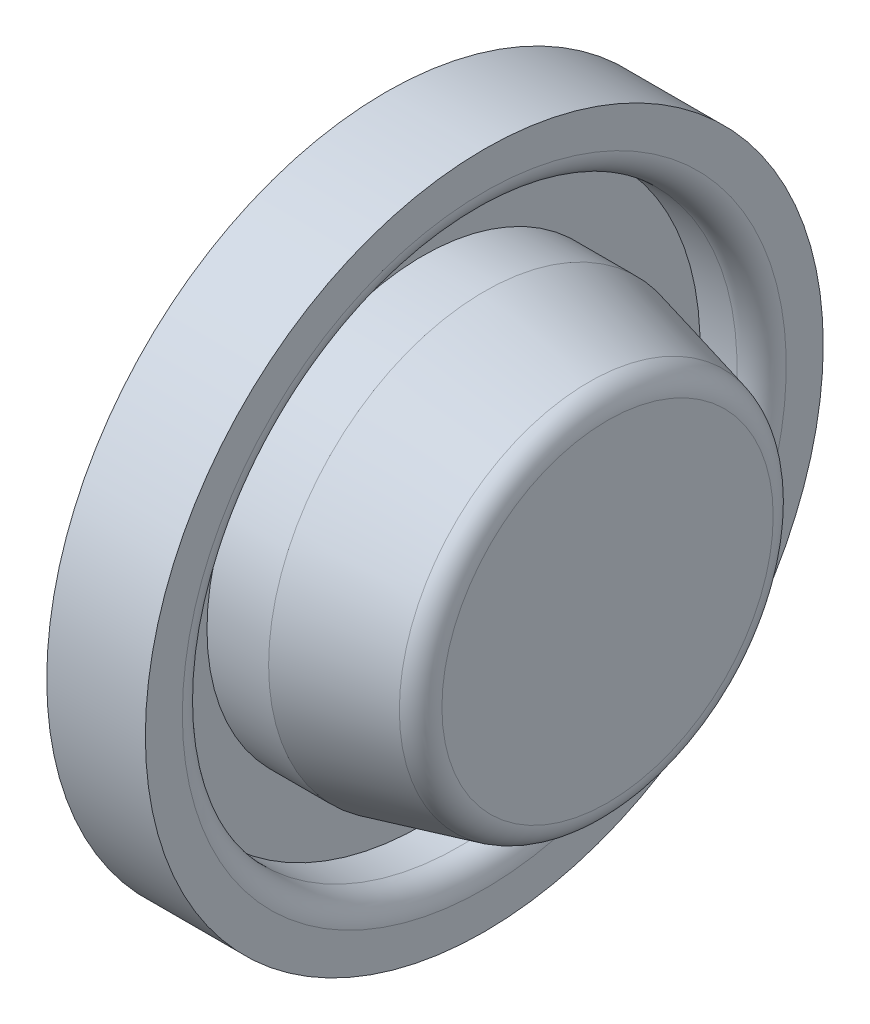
ISO-10303-21;
HEADER;
FILE_DESCRIPTION(('STEP AP214'),'2;1');
FILE_NAME('part.step','',(''),(''),'','','');
FILE_SCHEMA(('AUTOMOTIVE_DESIGN { 1 0 10303 214 1 1 1 1 }'));
ENDSEC;
DATA;
#1=APPLICATION_CONTEXT('core data for automotive mechanical design processes');
#2=APPLICATION_PROTOCOL_DEFINITION('international standard','automotive_design',2000,#1);
#3=PRODUCT_CONTEXT('',#1,'mechanical');
#4=PRODUCT('Part','Part','',(#3));
#5=PRODUCT_RELATED_PRODUCT_CATEGORY('part','',(#4));
#6=PRODUCT_DEFINITION_FORMATION('','',#4);
#7=PRODUCT_DEFINITION_CONTEXT('part definition',#1,'design');
#8=PRODUCT_DEFINITION('design','',#6,#7);
#9=PRODUCT_DEFINITION_SHAPE('','',#8);
#10=(LENGTH_UNIT() NAMED_UNIT(*) SI_UNIT(.MILLI.,.METRE.));
#11=(NAMED_UNIT(*) PLANE_ANGLE_UNIT() SI_UNIT($,.RADIAN.));
#12=(NAMED_UNIT(*) SI_UNIT($,.STERADIAN.) SOLID_ANGLE_UNIT());
#13=UNCERTAINTY_MEASURE_WITH_UNIT(LENGTH_MEASURE(1.E-05),#10,'distance_accuracy_value','');
#14=(GEOMETRIC_REPRESENTATION_CONTEXT(3) GLOBAL_UNCERTAINTY_ASSIGNED_CONTEXT((#13)) GLOBAL_UNIT_ASSIGNED_CONTEXT((#10,
#11,#12)) REPRESENTATION_CONTEXT('',''));
#15=CARTESIAN_POINT('',(0.,0.,0.));
#16=DIRECTION('',(0.,0.,1.));
#17=DIRECTION('',(1.,0.,0.));
#18=AXIS2_PLACEMENT_3D('',#15,#16,#17);
#19=CARTESIAN_POINT('',(0.,27.5,0.));
#20=DIRECTION('',(1.,0.,0.));
#21=DIRECTION('',(0.,0.,-1.));
#22=AXIS2_PLACEMENT_3D('',#19,#20,#21);
#23=PLANE('',#22);
#24=CARTESIAN_POINT('',(0.,0.,0.));
#25=DIRECTION('',(-1.,0.,0.));
#26=DIRECTION('',(0.,0.,1.));
#27=AXIS2_PLACEMENT_3D('',#24,#25,#26);
#28=CIRCLE('',#27,10.);
#29=CARTESIAN_POINT('',(0.,0.,10.));
#30=VERTEX_POINT('',#29);
#31=EDGE_CURVE('E67',#30,#30,#28,.T.);
#32=ORIENTED_EDGE('',*,*,#31,.F.);
#33=EDGE_LOOP('',(#32));
#34=FACE_BOUND('',#33,.T.);
#35=CARTESIAN_POINT('',(0.,0.,0.));
#36=DIRECTION('',(-1.,0.,0.));
#37=DIRECTION('',(0.,0.,1.));
#38=AXIS2_PLACEMENT_3D('',#35,#36,#37);
#39=CIRCLE('',#38,27.5);
#40=CARTESIAN_POINT('',(0.,0.,27.5));
#41=VERTEX_POINT('',#40);
#42=EDGE_CURVE('E63',#41,#41,#39,.T.);
#43=ORIENTED_EDGE('',*,*,#42,.T.);
#44=EDGE_LOOP('',(#43));
#45=FACE_BOUND('',#44,.T.);
#46=ADVANCED_FACE('F31',(#34,#45),#23,.F.);
#47=CARTESIAN_POINT('',(18.,0.,0.));
#48=DIRECTION('',(-1.,0.,0.));
#49=DIRECTION('',(0.,0.,1.));
#50=AXIS2_PLACEMENT_3D('',#47,#48,#49);
#51=PLANE('',#50);
#52=CARTESIAN_POINT('',(18.,0.,0.));
#53=DIRECTION('',(-1.,0.,0.));
#54=DIRECTION('',(0.,0.,1.));
#55=AXIS2_PLACEMENT_3D('',#52,#53,#54);
#56=CIRCLE('',#55,13.4384471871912);
#57=CARTESIAN_POINT('',(18.,0.,13.4384471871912));
#58=VERTEX_POINT('',#57);
#59=EDGE_CURVE('E42',#58,#58,#56,.F.);
#60=ORIENTED_EDGE('',*,*,#59,.T.);
#61=EDGE_LOOP('',(#60));
#62=FACE_BOUND('',#61,.T.);
#63=ADVANCED_FACE('F101',(#62),#51,.F.);
#64=CARTESIAN_POINT('',(18.,0.,0.));
#65=DIRECTION('',(-1.,0.,0.));
#66=DIRECTION('',(0.,0.,1.));
#67=AXIS2_PLACEMENT_3D('',#64,#65,#66);
#68=CONICAL_SURFACE('',#67,15.,0.244978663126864);
#69=CARTESIAN_POINT('',(16.4850712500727,0.,0.));
#70=DIRECTION('',(1.,0.,0.));
#71=DIRECTION('',(0.,0.,-1.));
#72=AXIS2_PLACEMENT_3D('',#69,#70,#71);
#73=CIRCLE('',#72,15.3787321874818);
#74=CARTESIAN_POINT('',(16.4850712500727,0.,-15.3787321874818));
#75=VERTEX_POINT('',#74);
#76=EDGE_CURVE('E46',#75,#75,#73,.F.);
#77=ORIENTED_EDGE('',*,*,#76,.T.);
#78=EDGE_LOOP('',(#77));
#79=FACE_BOUND('',#78,.T.);
#80=CARTESIAN_POINT('',(8.,0.,0.));
#81=DIRECTION('',(-1.,0.,0.));
#82=DIRECTION('',(0.,0.,1.));
#83=AXIS2_PLACEMENT_3D('',#80,#81,#82);
#84=CIRCLE('',#83,17.5);
#85=CARTESIAN_POINT('',(8.,0.,17.5));
#86=VERTEX_POINT('',#85);
#87=EDGE_CURVE('E51',#86,#86,#84,.T.);
#88=ORIENTED_EDGE('',*,*,#87,.F.);
#89=EDGE_LOOP('',(#88));
#90=FACE_BOUND('',#89,.T.);
#91=ADVANCED_FACE('F128',(#79,#90),#68,.T.);
#92=CARTESIAN_POINT('',(0.,0.,0.));
#93=DIRECTION('',(-1.,0.,0.));
#94=DIRECTION('',(0.,0.,1.));
#95=AXIS2_PLACEMENT_3D('',#92,#93,#94);
#96=CYLINDRICAL_SURFACE('',#95,17.5);
#97=CARTESIAN_POINT('',(3.,0.,0.));
#98=DIRECTION('',(-1.,0.,0.));
#99=DIRECTION('',(0.,0.,1.));
#100=AXIS2_PLACEMENT_3D('',#97,#98,#99);
#101=CIRCLE('',#100,17.5);
#102=CARTESIAN_POINT('',(3.,0.,17.5));
#103=VERTEX_POINT('',#102);
#104=EDGE_CURVE('E54',#103,#103,#101,.T.);
#105=ORIENTED_EDGE('',*,*,#104,.F.);
#106=EDGE_LOOP('',(#105));
#107=FACE_BOUND('',#106,.T.);
#108=ORIENTED_EDGE('',*,*,#87,.T.);
#109=EDGE_LOOP('',(#108));
#110=FACE_BOUND('',#109,.T.);
#111=ADVANCED_FACE('F124',(#107,#110),#96,.T.);
#112=CARTESIAN_POINT('',(3.,17.5,0.));
#113=DIRECTION('',(-1.,0.,0.));
#114=DIRECTION('',(0.,0.,1.));
#115=AXIS2_PLACEMENT_3D('',#112,#113,#114);
#116=PLANE('',#115);
#117=CARTESIAN_POINT('',(3.,0.,0.));
#118=DIRECTION('',(-1.,0.,0.));
#119=DIRECTION('',(0.,0.,1.));
#120=AXIS2_PLACEMENT_3D('',#117,#118,#119);
#121=CIRCLE('',#120,22.5);
#122=CARTESIAN_POINT('',(3.,0.,22.5));
#123=VERTEX_POINT('',#122);
#124=EDGE_CURVE('E57',#123,#123,#121,.T.);
#125=ORIENTED_EDGE('',*,*,#124,.F.);
#126=EDGE_LOOP('',(#125));
#127=FACE_BOUND('',#126,.T.);
#128=ORIENTED_EDGE('',*,*,#104,.T.);
#129=EDGE_LOOP('',(#128));
#130=FACE_BOUND('',#129,.T.);
#131=ADVANCED_FACE('F119',(#127,#130),#116,.F.);
#132=CARTESIAN_POINT('',(0.,0.,0.));
#133=DIRECTION('',(-1.,0.,0.));
#134=DIRECTION('',(0.,0.,1.));
#135=AXIS2_PLACEMENT_3D('',#132,#133,#134);
#136=CYLINDRICAL_SURFACE('',#135,22.5);
#137=CARTESIAN_POINT('',(6.,0.,0.));
#138=DIRECTION('',(-1.,0.,0.));
#139=DIRECTION('',(0.,0.,1.));
#140=AXIS2_PLACEMENT_3D('',#137,#138,#139);
#141=CIRCLE('',#140,22.5);
#142=CARTESIAN_POINT('',(6.,0.,22.5));
#143=VERTEX_POINT('',#142);
#144=EDGE_CURVE('E10',#143,#143,#141,.F.);
#145=ORIENTED_EDGE('',*,*,#144,.T.);
#146=EDGE_LOOP('',(#145));
#147=FACE_BOUND('',#146,.T.);
#148=ORIENTED_EDGE('',*,*,#124,.T.);
#149=EDGE_LOOP('',(#148));
#150=FACE_BOUND('',#149,.T.);
#151=ADVANCED_FACE('F114',(#147,#150),#136,.F.);
#152=CARTESIAN_POINT('',(8.,22.5,0.));
#153=DIRECTION('',(-1.,0.,0.));
#154=DIRECTION('',(0.,0.,1.));
#155=AXIS2_PLACEMENT_3D('',#152,#153,#154);
#156=PLANE('',#155);
#157=CARTESIAN_POINT('',(8.,0.,0.));
#158=DIRECTION('',(-1.,0.,0.));
#159=DIRECTION('',(0.,0.,1.));
#160=AXIS2_PLACEMENT_3D('',#157,#158,#159);
#161=CIRCLE('',#160,24.5);
#162=CARTESIAN_POINT('',(8.,0.,24.5));
#163=VERTEX_POINT('',#162);
#164=EDGE_CURVE('E38',#163,#163,#161,.T.);
#165=ORIENTED_EDGE('',*,*,#164,.T.);
#166=EDGE_LOOP('',(#165));
#167=FACE_BOUND('',#166,.T.);
#168=CARTESIAN_POINT('',(8.,0.,0.));
#169=DIRECTION('',(-1.,0.,0.));
#170=DIRECTION('',(0.,0.,1.));
#171=AXIS2_PLACEMENT_3D('',#168,#169,#170);
#172=CIRCLE('',#171,27.5);
#173=CARTESIAN_POINT('',(8.,0.,27.5));
#174=VERTEX_POINT('',#173);
#175=EDGE_CURVE('E60',#174,#174,#172,.T.);
#176=ORIENTED_EDGE('',*,*,#175,.F.);
#177=EDGE_LOOP('',(#176));
#178=FACE_BOUND('',#177,.T.);
#179=ADVANCED_FACE('F109',(#167,#178),#156,.F.);
#180=CARTESIAN_POINT('',(0.,0.,0.));
#181=DIRECTION('',(-1.,0.,0.));
#182=DIRECTION('',(0.,0.,1.));
#183=AXIS2_PLACEMENT_3D('',#180,#181,#182);
#184=CYLINDRICAL_SURFACE('',#183,27.5);
#185=ORIENTED_EDGE('',*,*,#42,.F.);
#186=EDGE_LOOP('',(#185));
#187=FACE_BOUND('',#186,.T.);
#188=ORIENTED_EDGE('',*,*,#175,.T.);
#189=EDGE_LOOP('',(#188));
#190=FACE_BOUND('',#189,.T.);
#191=ADVANCED_FACE('F105',(#187,#190),#184,.T.);
#192=CARTESIAN_POINT('',(16.,0.,0.));
#193=DIRECTION('',(-1.,0.,0.));
#194=DIRECTION('',(0.,0.,1.));
#195=AXIS2_PLACEMENT_3D('',#192,#193,#194);
#196=TOROIDAL_SURFACE('',#195,13.4384471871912,2.);
#197=ORIENTED_EDGE('',*,*,#59,.F.);
#198=EDGE_LOOP('',(#197));
#199=FACE_BOUND('',#198,.T.);
#200=ORIENTED_EDGE('',*,*,#76,.F.);
#201=EDGE_LOOP('',(#200));
#202=FACE_BOUND('',#201,.T.);
#203=ADVANCED_FACE('F108',(#199,#202),#196,.T.);
#204=CARTESIAN_POINT('',(6.,0.,0.));
#205=DIRECTION('',(-1.,0.,0.));
#206=DIRECTION('',(0.,0.,1.));
#207=AXIS2_PLACEMENT_3D('',#204,#205,#206);
#208=TOROIDAL_SURFACE('',#207,24.5,2.);
#209=ORIENTED_EDGE('',*,*,#144,.F.);
#210=EDGE_LOOP('',(#209));
#211=FACE_BOUND('',#210,.T.);
#212=ORIENTED_EDGE('',*,*,#164,.F.);
#213=EDGE_LOOP('',(#212));
#214=FACE_BOUND('',#213,.T.);
#215=ADVANCED_FACE('F33',(#211,#214),#208,.T.);
#216=CARTESIAN_POINT('',(3.,0.,0.));
#217=DIRECTION('',(-1.,0.,0.));
#218=DIRECTION('',(0.,0.,1.));
#219=AXIS2_PLACEMENT_3D('',#216,#217,#218);
#220=CYLINDRICAL_SURFACE('',#219,10.);
#221=CARTESIAN_POINT('',(3.,0.,0.));
#222=DIRECTION('',(-1.,0.,0.));
#223=DIRECTION('',(0.,0.,1.));
#224=AXIS2_PLACEMENT_3D('',#221,#222,#223);
#225=CIRCLE('',#224,10.);
#226=CARTESIAN_POINT('',(3.,0.,10.));
#227=VERTEX_POINT('',#226);
#228=EDGE_CURVE('E66',#227,#227,#225,.T.);
#229=ORIENTED_EDGE('',*,*,#228,.F.);
#230=EDGE_LOOP('',(#229));
#231=FACE_BOUND('',#230,.T.);
#232=ORIENTED_EDGE('',*,*,#31,.T.);
#233=EDGE_LOOP('',(#232));
#234=FACE_BOUND('',#233,.T.);
#235=ADVANCED_FACE('F90',(#231,#234),#220,.F.);
#236=CARTESIAN_POINT('',(3.,0.,0.));
#237=DIRECTION('',(-1.,0.,0.));
#238=DIRECTION('',(0.,0.,1.));
#239=AXIS2_PLACEMENT_3D('',#236,#237,#238);
#240=PLANE('',#239);
#241=CARTESIAN_POINT('',(3.,0.,0.));
#242=DIRECTION('',(-1.,0.,0.));
#243=DIRECTION('',(0.,0.,1.));
#244=AXIS2_PLACEMENT_3D('',#241,#242,#243);
#245=CIRCLE('',#244,5.5);
#246=CARTESIAN_POINT('',(3.,0.,5.5));
#247=VERTEX_POINT('',#246);
#248=EDGE_CURVE('E73',#247,#247,#245,.T.);
#249=ORIENTED_EDGE('',*,*,#248,.F.);
#250=EDGE_LOOP('',(#249));
#251=FACE_BOUND('',#250,.T.);
#252=ORIENTED_EDGE('',*,*,#228,.T.);
#253=EDGE_LOOP('',(#252));
#254=FACE_BOUND('',#253,.T.);
#255=ADVANCED_FACE('F84',(#251,#254),#240,.T.);
#256=CARTESIAN_POINT('',(15.,0.,0.));
#257=DIRECTION('',(-1.,0.,0.));
#258=DIRECTION('',(0.,0.,1.));
#259=AXIS2_PLACEMENT_3D('',#256,#257,#258);
#260=CYLINDRICAL_SURFACE('',#259,5.5);
#261=CARTESIAN_POINT('',(15.,0.,0.));
#262=DIRECTION('',(-1.,0.,0.));
#263=DIRECTION('',(0.,0.,1.));
#264=AXIS2_PLACEMENT_3D('',#261,#262,#263);
#265=CIRCLE('',#264,5.5);
#266=CARTESIAN_POINT('',(15.,0.,5.5));
#267=VERTEX_POINT('',#266);
#268=EDGE_CURVE('E70',#267,#267,#265,.T.);
#269=ORIENTED_EDGE('',*,*,#268,.F.);
#270=EDGE_LOOP('',(#269));
#271=FACE_BOUND('',#270,.T.);
#272=ORIENTED_EDGE('',*,*,#248,.T.);
#273=EDGE_LOOP('',(#272));
#274=FACE_BOUND('',#273,.T.);
#275=ADVANCED_FACE('F81',(#271,#274),#260,.F.);
#276=CARTESIAN_POINT('',(15.,0.,0.));
#277=DIRECTION('',(-1.,0.,0.));
#278=DIRECTION('',(0.,0.,1.));
#279=AXIS2_PLACEMENT_3D('',#276,#277,#278);
#280=PLANE('',#279);
#281=ORIENTED_EDGE('',*,*,#268,.T.);
#282=EDGE_LOOP('',(#281));
#283=FACE_BOUND('',#282,.T.);
#284=ADVANCED_FACE('F79',(#283),#280,.T.);
#285=CLOSED_SHELL('',(#46,#63,#91,#111,#131,#151,#179,#191,#203,#215,#235,#255,#275,#284));
#286=MANIFOLD_SOLID_BREP('B2',#285);
#287=ADVANCED_BREP_SHAPE_REPRESENTATION('',(#18,#286),#14);
#288=SHAPE_DEFINITION_REPRESENTATION(#9,#287);
ENDSEC;
END-ISO-10303-21;
